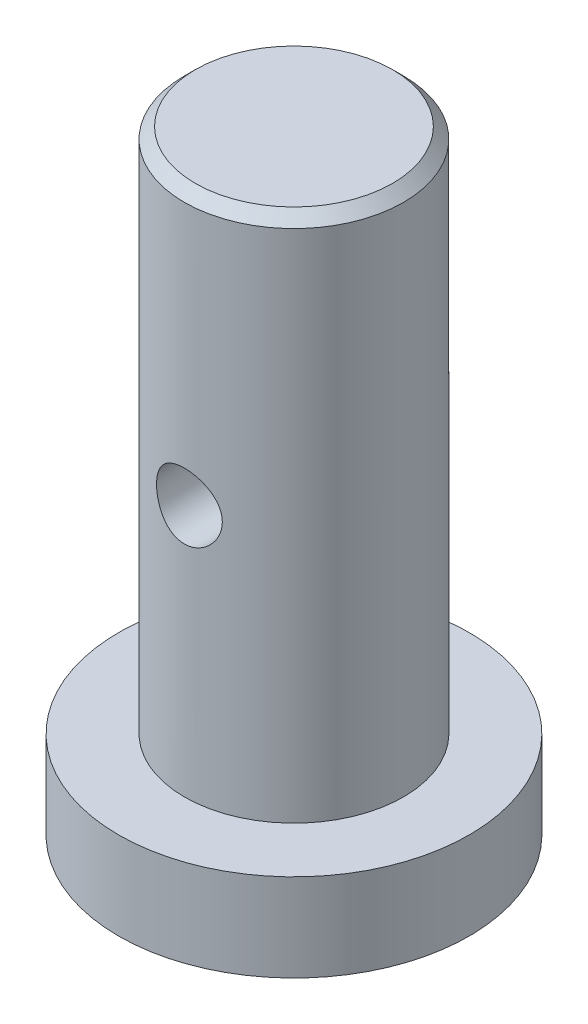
ISO-10303-21;
HEADER;
FILE_DESCRIPTION(('STEP AP214'),'2;1');
FILE_NAME('part.step','',(''),(''),'','','');
FILE_SCHEMA(('AUTOMOTIVE_DESIGN { 1 0 10303 214 1 1 1 1 }'));
ENDSEC;
DATA;
#1=APPLICATION_CONTEXT('core data for automotive mechanical design processes');
#2=APPLICATION_PROTOCOL_DEFINITION('international standard','automotive_design',2000,#1);
#3=PRODUCT_CONTEXT('',#1,'mechanical');
#4=PRODUCT('Part','Part','',(#3));
#5=PRODUCT_RELATED_PRODUCT_CATEGORY('part','',(#4));
#6=PRODUCT_DEFINITION_FORMATION('','',#4);
#7=PRODUCT_DEFINITION_CONTEXT('part definition',#1,'design');
#8=PRODUCT_DEFINITION('design','',#6,#7);
#9=PRODUCT_DEFINITION_SHAPE('','',#8);
#10=(LENGTH_UNIT() NAMED_UNIT(*) SI_UNIT(.MILLI.,.METRE.));
#11=(NAMED_UNIT(*) PLANE_ANGLE_UNIT() SI_UNIT($,.RADIAN.));
#12=(NAMED_UNIT(*) SI_UNIT($,.STERADIAN.) SOLID_ANGLE_UNIT());
#13=UNCERTAINTY_MEASURE_WITH_UNIT(LENGTH_MEASURE(1.E-05),#10,'distance_accuracy_value','');
#14=(GEOMETRIC_REPRESENTATION_CONTEXT(3) GLOBAL_UNCERTAINTY_ASSIGNED_CONTEXT((#13)) GLOBAL_UNIT_ASSIGNED_CONTEXT((#10,
#11,#12)) REPRESENTATION_CONTEXT('',''));
#15=CARTESIAN_POINT('',(0.,0.,0.));
#16=DIRECTION('',(0.,0.,1.));
#17=DIRECTION('',(1.,0.,0.));
#18=AXIS2_PLACEMENT_3D('',#15,#16,#17);
#19=CARTESIAN_POINT('',(-1.11022302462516E-13,27.9999999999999,0.));
#20=DIRECTION('',(0.,-1.,0.));
#21=DIRECTION('',(0.,0.,-1.00000000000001));
#22=AXIS2_PLACEMENT_3D('',#19,#20,#21);
#23=PLANE('',#22);
#24=CARTESIAN_POINT('',(-1.11022302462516E-13,27.9999999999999,0.));
#25=DIRECTION('',(0.,-1.,0.));
#26=DIRECTION('',(0.,0.,-1.00000000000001));
#27=AXIS2_PLACEMENT_3D('',#24,#25,#26);
#28=CIRCLE('',#27,4.5);
#29=CARTESIAN_POINT('',(-1.11022302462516E-13,27.9999999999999,-4.5000000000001));
#30=VERTEX_POINT('',#29);
#31=EDGE_CURVE('E42',#30,#30,#28,.F.);
#32=ORIENTED_EDGE('',*,*,#31,.T.);
#33=EDGE_LOOP('',(#32));
#34=FACE_BOUND('',#33,.T.);
#35=ADVANCED_FACE('F31',(#34),#23,.F.);
#36=CARTESIAN_POINT('',(0.,0.,0.));
#37=DIRECTION('',(0.,1.,0.));
#38=DIRECTION('',(0.,0.,1.00000000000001));
#39=AXIS2_PLACEMENT_3D('',#36,#37,#38);
#40=PLANE('',#39);
#41=CARTESIAN_POINT('',(0.,0.,0.));
#42=DIRECTION('',(0.,1.,0.));
#43=DIRECTION('',(0.,0.,1.00000000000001));
#44=AXIS2_PLACEMENT_3D('',#41,#42,#43);
#45=CIRCLE('',#44,8.);
#46=CARTESIAN_POINT('',(0.,0.,8.00000000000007));
#47=VERTEX_POINT('',#46);
#48=EDGE_CURVE('E47',#47,#47,#45,.T.);
#49=ORIENTED_EDGE('',*,*,#48,.F.);
#50=EDGE_LOOP('',(#49));
#51=FACE_BOUND('',#50,.T.);
#52=ADVANCED_FACE('F73',(#51),#40,.F.);
#53=CARTESIAN_POINT('',(1.11022302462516E-13,103.591101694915,3.88578058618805E-13));
#54=DIRECTION('',(0.,1.,0.));
#55=DIRECTION('',(0.,0.,1.00000000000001));
#56=AXIS2_PLACEMENT_3D('',#53,#54,#55);
#57=CYLINDRICAL_SURFACE('',#56,8.);
#58=CARTESIAN_POINT('',(-3.33066907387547E-13,4.,0.));
#59=DIRECTION('',(0.,1.,0.));
#60=DIRECTION('',(0.,0.,1.00000000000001));
#61=AXIS2_PLACEMENT_3D('',#58,#59,#60);
#62=CIRCLE('',#61,8.);
#63=CARTESIAN_POINT('',(-3.33066907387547E-13,4.,8.00000000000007));
#64=VERTEX_POINT('',#63);
#65=EDGE_CURVE('E97',#64,#64,#62,.T.);
#66=ORIENTED_EDGE('',*,*,#65,.F.);
#67=EDGE_LOOP('',(#66));
#68=FACE_BOUND('',#67,.T.);
#69=ORIENTED_EDGE('',*,*,#48,.T.);
#70=EDGE_LOOP('',(#69));
#71=FACE_BOUND('',#70,.T.);
#72=ADVANCED_FACE('F78',(#68,#71),#57,.T.);
#73=CARTESIAN_POINT('',(8.00000000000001,3.99999999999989,0.));
#74=DIRECTION('',(0.,-1.,0.));
#75=DIRECTION('',(0.,0.,-1.00000000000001));
#76=AXIS2_PLACEMENT_3D('',#73,#74,#75);
#77=PLANE('',#76);
#78=CARTESIAN_POINT('',(-3.33066907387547E-13,4.,0.));
#79=DIRECTION('',(0.,1.,0.));
#80=DIRECTION('',(0.,0.,1.00000000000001));
#81=AXIS2_PLACEMENT_3D('',#78,#79,#80);
#82=CIRCLE('',#81,5.);
#83=CARTESIAN_POINT('',(-3.33066907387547E-13,4.,5.00000000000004));
#84=VERTEX_POINT('',#83);
#85=EDGE_CURVE('E94',#84,#84,#82,.T.);
#86=ORIENTED_EDGE('',*,*,#85,.F.);
#87=EDGE_LOOP('',(#86));
#88=FACE_BOUND('',#87,.T.);
#89=ORIENTED_EDGE('',*,*,#65,.T.);
#90=EDGE_LOOP('',(#89));
#91=FACE_BOUND('',#90,.T.);
#92=ADVANCED_FACE('F69',(#88,#91),#77,.F.);
#93=CARTESIAN_POINT('',(1.11022302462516E-13,103.591101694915,3.88578058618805E-13));
#94=DIRECTION('',(0.,1.,0.));
#95=DIRECTION('',(0.,0.,1.00000000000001));
#96=AXIS2_PLACEMENT_3D('',#93,#94,#95);
#97=CYLINDRICAL_SURFACE('',#96,5.);
#98=CARTESIAN_POINT('',(6.10622663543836E-13,14.,5.00000000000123));
#99=CARTESIAN_POINT('',(-0.0822886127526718,14.0000009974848,4.9999992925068));
#100=CARTESIAN_POINT('',(-0.164587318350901,14.0067938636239,4.9979491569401));
#101=CARTESIAN_POINT('',(-0.326788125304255,14.033721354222,4.98997105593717));
#102=CARTESIAN_POINT('',(-0.406689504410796,14.0538599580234,4.98404193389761));
#103=CARTESIAN_POINT('',(-0.561732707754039,14.1067460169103,4.96895552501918));
#104=CARTESIAN_POINT('',(-0.636881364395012,14.1394748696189,4.95980300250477));
#105=CARTESIAN_POINT('',(-0.780624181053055,14.2165360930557,4.93922109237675));
#106=CARTESIAN_POINT('',(-0.849217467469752,14.2608700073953,4.92779140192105));
#107=CARTESIAN_POINT('',(-0.979871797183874,14.3612240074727,4.90350737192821));
#108=CARTESIAN_POINT('',(-1.04171807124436,14.417516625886,4.89062383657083));
#109=CARTESIAN_POINT('',(-1.15524920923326,14.5396092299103,4.86505834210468));
#110=CARTESIAN_POINT('',(-1.20693236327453,14.605410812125,4.85237641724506));
#111=CARTESIAN_POINT('',(-1.29980037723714,14.7464707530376,4.8283411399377));
#112=CARTESIAN_POINT('',(-1.34072309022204,14.8219084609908,4.81702406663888));
#113=CARTESIAN_POINT('',(-1.40921394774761,14.9789892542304,4.79743620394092));
#114=CARTESIAN_POINT('',(-1.43678529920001,15.060630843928,4.78916468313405));
#115=CARTESIAN_POINT('',(-1.47701633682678,15.2253902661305,4.7769087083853));
#116=CARTESIAN_POINT('',(-1.49007196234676,15.308402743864,4.77281069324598));
#117=CARTESIAN_POINT('',(-1.50213730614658,15.4755331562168,4.76902789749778));
#118=CARTESIAN_POINT('',(-1.50115042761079,15.5596508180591,4.76934204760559));
#119=CARTESIAN_POINT('',(-1.48546977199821,15.7233839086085,4.77424744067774));
#120=CARTESIAN_POINT('',(-1.47127205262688,15.8030522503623,4.77868388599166));
#121=CARTESIAN_POINT('',(-1.43037420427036,15.9588197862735,4.79108356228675));
#122=CARTESIAN_POINT('',(-1.40367284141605,16.0349186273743,4.79904714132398));
#123=CARTESIAN_POINT('',(-1.33816026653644,16.1826003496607,4.81772733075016));
#124=CARTESIAN_POINT('',(-1.2991881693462,16.2541070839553,4.82848016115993));
#125=CARTESIAN_POINT('',(-1.21035222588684,16.3897320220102,4.85150987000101));
#126=CARTESIAN_POINT('',(-1.16048574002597,16.4538484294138,4.86378711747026));
#127=CARTESIAN_POINT('',(-1.04881290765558,16.575686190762,4.8891101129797));
#128=CARTESIAN_POINT('',(-0.986594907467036,16.6330286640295,4.90216654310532));
#129=CARTESIAN_POINT('',(-0.85326325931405,16.7365539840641,4.92712244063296));
#130=CARTESIAN_POINT('',(-0.782149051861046,16.7827361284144,4.93902183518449));
#131=CARTESIAN_POINT('',(-0.632355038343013,16.8628599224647,4.96043160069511));
#132=CARTESIAN_POINT('',(-0.553627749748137,16.8967175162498,4.96992543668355));
#133=CARTESIAN_POINT('',(-0.391245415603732,16.9505995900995,4.98533521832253));
#134=CARTESIAN_POINT('',(-0.307591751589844,16.9706279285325,4.99125216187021));
#135=CARTESIAN_POINT('',(-0.14095224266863,16.9956521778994,4.99868364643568));
#136=CARTESIAN_POINT('',(-0.0580500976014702,17.0011615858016,5.00034850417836));
#137=CARTESIAN_POINT('',(0.10749960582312,16.9984308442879,4.99952923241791));
#138=CARTESIAN_POINT('',(0.190147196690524,16.9901925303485,4.99704565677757));
#139=CARTESIAN_POINT('',(0.350903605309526,16.9606153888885,4.9883069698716));
#140=CARTESIAN_POINT('',(0.429072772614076,16.9395766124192,4.98213829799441));
#141=CARTESIAN_POINT('',(0.580754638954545,16.8853567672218,4.96674347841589));
#142=CARTESIAN_POINT('',(0.654266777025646,16.8521742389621,4.95751696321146));
#143=CARTESIAN_POINT('',(0.796437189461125,16.7737468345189,4.93669654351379));
#144=CARTESIAN_POINT('',(0.864943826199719,16.7282406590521,4.92505280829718));
#145=CARTESIAN_POINT('',(0.99352330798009,16.6267752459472,4.90073468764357));
#146=CARTESIAN_POINT('',(1.05359403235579,16.5708133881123,4.88806004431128));
#147=CARTESIAN_POINT('',(1.16585744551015,16.4476126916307,4.86253171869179));
#148=CARTESIAN_POINT('',(1.21768481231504,16.3800381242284,4.84968825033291));
#149=CARTESIAN_POINT('',(1.30928995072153,16.2368720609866,4.82576515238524));
#150=CARTESIAN_POINT('',(1.3490680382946,16.1612807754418,4.81468547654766));
#151=CARTESIAN_POINT('',(1.41517347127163,16.0044675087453,4.79567189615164));
#152=CARTESIAN_POINT('',(1.44156346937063,15.9232738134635,4.78772337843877));
#153=CARTESIAN_POINT('',(1.48021730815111,15.7573120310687,4.77591594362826));
#154=CARTESIAN_POINT('',(1.49248598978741,15.6725451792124,4.77205562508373));
#155=CARTESIAN_POINT('',(1.5022198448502,15.5056384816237,4.76899972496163));
#156=CARTESIAN_POINT('',(1.50028055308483,15.4235363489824,4.76961647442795));
#157=CARTESIAN_POINT('',(1.48307505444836,15.2608858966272,4.77499401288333));
#158=CARTESIAN_POINT('',(1.46780938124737,15.1803375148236,4.77975463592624));
#159=CARTESIAN_POINT('',(1.4247688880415,15.0240546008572,4.79275763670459));
#160=CARTESIAN_POINT('',(1.39715175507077,14.9482727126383,4.80095604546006));
#161=CARTESIAN_POINT('',(1.33031507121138,14.8023575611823,4.81990278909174));
#162=CARTESIAN_POINT('',(1.29109329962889,14.7322253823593,4.83065161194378));
#163=CARTESIAN_POINT('',(1.20048763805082,14.5968368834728,4.85397676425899));
#164=CARTESIAN_POINT('',(1.14871276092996,14.5318512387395,4.86660540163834));
#165=CARTESIAN_POINT('',(1.03517434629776,14.411297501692,4.89201320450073));
#166=CARTESIAN_POINT('',(0.973408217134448,14.3557318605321,4.90479240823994));
#167=CARTESIAN_POINT('',(0.839465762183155,14.2539765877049,4.9295093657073));
#168=CARTESIAN_POINT('',(0.767037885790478,14.2081085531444,4.94141159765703));
#169=CARTESIAN_POINT('',(0.61514137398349,14.1292648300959,4.96260680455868));
#170=CARTESIAN_POINT('',(0.535676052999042,14.0962831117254,4.97190099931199));
#171=CARTESIAN_POINT('',(0.380757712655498,14.0471047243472,4.98602174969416));
#172=CARTESIAN_POINT('',(0.305786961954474,14.0294883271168,4.99122027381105));
#173=CARTESIAN_POINT('',(0.153880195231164,14.0059364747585,4.99820944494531));
#174=CARTESIAN_POINT('',(0.0769445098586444,13.9999990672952,5.00000066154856));
#175=CARTESIAN_POINT('',(6.10622663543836E-13,14.,5.00000000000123));
#176=B_SPLINE_CURVE_WITH_KNOTS('',3,(#98,#99,#100,#101,#102,#103,#104,#105,#106,#107,#108,#109,
#110,#111,#112,#113,#114,#115,#116,#117,#118,#119,#120,#121,#122,#123,#124,#125,#126,#127,#128,
#129,#130,#131,#132,#133,#134,#135,#136,#137,#138,#139,#140,#141,#142,#143,#144,#145,#146,#147,
#148,#149,#150,#151,#152,#153,#154,#155,#156,#157,#158,#159,#160,#161,#162,#163,#164,#165,#166,
#167,#168,#169,#170,#171,#172,#173,#174,#175),.UNSPECIFIED.,.T.,.F.,(4,2,2,2,2,2,2,2,2,2,2,2,2,
2,2,2,2,2,2,2,2,2,2,2,2,2,2,2,2,2,2,2,2,2,2,2,2,2,4),(0.,0.2465832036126,0.493239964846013,
0.739533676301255,0.985860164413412,1.23855602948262,1.49129437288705,1.74971481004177,
2.00807314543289,2.25919689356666,2.51025978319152,2.75226016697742,2.99428443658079,
3.23962426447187,3.48502360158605,3.7406710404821,3.99633456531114,4.25371046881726,
4.51101453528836,4.75908809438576,5.00712853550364,5.24956746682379,5.49203554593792,
5.74011305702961,5.98825282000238,6.24540400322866,6.50254844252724,6.75847814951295,
7.01432009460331,7.25950155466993,7.50467319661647,7.74680040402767,7.98897397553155,
8.23996925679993,8.49102974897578,8.74942996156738,9.00770911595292,9.2383169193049,
9.46888616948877),.UNSPECIFIED.);
#177=CARTESIAN_POINT('',(6.10622663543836E-13,14.,5.00000000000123));
#178=VERTEX_POINT('',#177);
#179=EDGE_CURVE('E34',#178,#178,#176,.T.);
#180=ORIENTED_EDGE('',*,*,#179,.T.);
#181=EDGE_LOOP('',(#180));
#182=FACE_BOUND('',#181,.T.);
#183=CARTESIAN_POINT('',(1.49999999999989,15.5,-4.76969600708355));
#184=CARTESIAN_POINT('',(1.49999897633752,15.5821945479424,-4.76969685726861));
#185=CARTESIAN_POINT('',(1.49322108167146,15.664399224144,-4.77184390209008));
#186=CARTESIAN_POINT('',(1.46635844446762,15.8264052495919,-4.78016578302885));
#187=CARTESIAN_POINT('',(1.44626925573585,15.9062057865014,-4.78634196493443));
#188=CARTESIAN_POINT('',(1.39352753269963,16.0610347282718,-4.80196102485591));
#189=CARTESIAN_POINT('',(1.36089589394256,16.1360708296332,-4.81139846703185));
#190=CARTESIAN_POINT('',(1.28406421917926,16.2796219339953,-4.8324693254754));
#191=CARTESIAN_POINT('',(1.23986245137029,16.3481359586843,-4.84410307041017));
#192=CARTESIAN_POINT('',(1.139647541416,16.4788663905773,-4.86866862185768));
#193=CARTESIAN_POINT('',(1.08333207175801,16.5408458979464,-4.88162808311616));
#194=CARTESIAN_POINT('',(0.961136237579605,16.6546379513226,-4.90714861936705));
#195=CARTESIAN_POINT('',(0.895254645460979,16.7064491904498,-4.91970964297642));
#196=CARTESIAN_POINT('',(0.754111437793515,16.7994626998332,-4.94333214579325));
#197=CARTESIAN_POINT('',(0.678684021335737,16.8404234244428,-4.95435724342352));
#198=CARTESIAN_POINT('',(0.521624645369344,16.9089872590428,-4.97334435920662));
#199=CARTESIAN_POINT('',(0.439994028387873,16.9365932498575,-4.98130703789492));
#200=CARTESIAN_POINT('',(0.275323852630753,16.9768800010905,-4.99307646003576));
#201=CARTESIAN_POINT('',(0.192391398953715,16.9899651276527,-4.99699557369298));
#202=CARTESIAN_POINT('',(0.0254218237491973,17.0021173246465,-5.00063201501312));
#203=CARTESIAN_POINT('',(-0.0586150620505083,17.001187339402,-5.00035022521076));
#204=CARTESIAN_POINT('',(-0.222571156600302,16.9856071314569,-4.99569603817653));
#205=CARTESIAN_POINT('',(-0.302536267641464,16.9713948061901,-4.99145420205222));
#206=CARTESIAN_POINT('',(-0.458889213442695,16.9303686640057,-4.9795152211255));
#207=CARTESIAN_POINT('',(-0.53527682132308,16.9035540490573,-4.9718178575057));
#208=CARTESIAN_POINT('',(-0.683347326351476,16.8377879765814,-4.95365220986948));
#209=CARTESIAN_POINT('',(-0.754965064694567,16.7986987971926,-4.94315269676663));
#210=CARTESIAN_POINT('',(-0.890764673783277,16.7096021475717,-4.92049640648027));
#211=CARTESIAN_POINT('',(-0.954944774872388,16.6595920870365,-4.90833923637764));
#212=CARTESIAN_POINT('',(-1.07666048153,16.5478022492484,-4.88311550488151));
#213=CARTESIAN_POINT('',(-1.13384458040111,16.4856430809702,-4.87003195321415));
#214=CARTESIAN_POINT('',(-1.23707651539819,16.3524899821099,-4.84483979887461));
#215=CARTESIAN_POINT('',(-1.28312324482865,16.2814951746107,-4.83273129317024));
#216=CARTESIAN_POINT('',(-1.36313995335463,16.131760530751,-4.81077903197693));
#217=CARTESIAN_POINT('',(-1.39698989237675,16.0529529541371,-4.80095810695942));
#218=CARTESIAN_POINT('',(-1.45083362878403,15.8903927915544,-4.78496392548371));
#219=CARTESIAN_POINT('',(-1.47083194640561,15.8066418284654,-4.77878947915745));
#220=CARTESIAN_POINT('',(-1.49574770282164,15.6399176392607,-4.77104849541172));
#221=CARTESIAN_POINT('',(-1.50119946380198,15.5570317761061,-4.76931878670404));
#222=CARTESIAN_POINT('',(-1.4983594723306,15.3915270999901,-4.77021192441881));
#223=CARTESIAN_POINT('',(-1.49006964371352,15.3089082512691,-4.77283416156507));
#224=CARTESIAN_POINT('',(-1.46045763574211,15.1485116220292,-4.78197558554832));
#225=CARTESIAN_POINT('',(-1.43947961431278,15.0706638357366,-4.78839176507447));
#226=CARTESIAN_POINT('',(-1.38548577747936,14.9195983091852,-4.80429141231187));
#227=CARTESIAN_POINT('',(-1.35246810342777,14.8463812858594,-4.81377535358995));
#228=CARTESIAN_POINT('',(-1.27431871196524,14.7044825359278,-4.83505835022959));
#229=CARTESIAN_POINT('',(-1.22888564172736,14.6359752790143,-4.8469127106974));
#230=CARTESIAN_POINT('',(-1.12755301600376,14.5073618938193,-4.87148205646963));
#231=CARTESIAN_POINT('',(-1.0716509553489,14.4472577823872,-4.88419724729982));
#232=CARTESIAN_POINT('',(-0.948455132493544,14.3348195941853,-4.9096363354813));
#233=CARTESIAN_POINT('',(-0.880811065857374,14.2828643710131,-4.92234245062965));
#234=CARTESIAN_POINT('',(-0.737461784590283,14.1910332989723,-4.94584851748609));
#235=CARTESIAN_POINT('',(-0.661756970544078,14.1511568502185,-4.95664856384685));
#236=CARTESIAN_POINT('',(-0.504935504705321,14.0849999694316,-4.97505970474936));
#237=CARTESIAN_POINT('',(-0.423864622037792,14.058617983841,-4.98269453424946));
#238=CARTESIAN_POINT('',(-0.258169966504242,14.0199390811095,-4.9940197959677));
#239=CARTESIAN_POINT('',(-0.173547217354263,14.0076381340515,-4.99771135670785));
#240=CARTESIAN_POINT('',(-0.00665215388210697,13.9977769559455,-5.00066544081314));
#241=CARTESIAN_POINT('',(0.0755851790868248,13.9996673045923,-5.00009305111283));
#242=CARTESIAN_POINT('',(0.238519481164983,14.0168216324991,-4.99497264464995));
#243=CARTESIAN_POINT('',(0.319216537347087,14.0320848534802,-4.99042485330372));
#244=CARTESIAN_POINT('',(0.475935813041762,14.0752116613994,-4.97791168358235));
#245=CARTESIAN_POINT('',(0.551998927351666,14.102938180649,-4.96998352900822));
#246=CARTESIAN_POINT('',(0.698433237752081,14.1700819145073,-4.95152943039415));
#247=CARTESIAN_POINT('',(0.76880349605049,14.2095010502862,-4.94100305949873));
#248=CARTESIAN_POINT('',(0.904301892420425,14.3003734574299,-4.91803965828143));
#249=CARTESIAN_POINT('',(0.969190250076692,14.3521714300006,-4.90555226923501));
#250=CARTESIAN_POINT('',(1.08953757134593,14.4657103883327,-4.88023537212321));
#251=CARTESIAN_POINT('',(1.14499380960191,14.5274542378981,-4.86740576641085));
#252=CARTESIAN_POINT('',(1.24656269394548,14.6613407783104,-4.84240680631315));
#253=CARTESIAN_POINT('',(1.29234759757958,14.7337385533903,-4.83026852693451));
#254=CARTESIAN_POINT('',(1.37104313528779,14.8855551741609,-4.80852547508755));
#255=CARTESIAN_POINT('',(1.40395995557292,14.9649706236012,-4.79891948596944));
#256=CARTESIAN_POINT('',(1.45301942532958,15.1197404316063,-4.78427816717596));
#257=CARTESIAN_POINT('',(1.47058859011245,15.194608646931,-4.77886154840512));
#258=CARTESIAN_POINT('',(1.49407818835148,15.3463152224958,-4.77157042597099));
#259=CARTESIAN_POINT('',(1.50000095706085,15.4231531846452,-4.76969521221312));
#260=CARTESIAN_POINT('',(1.49999999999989,15.5,-4.76969600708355));
#261=B_SPLINE_CURVE_WITH_KNOTS('',3,(#183,#184,#185,#186,#187,#188,#189,#190,#191,#192,#193,
#194,#195,#196,#197,#198,#199,#200,#201,#202,#203,#204,#205,#206,#207,#208,#209,#210,#211,#212,
#213,#214,#215,#216,#217,#218,#219,#220,#221,#222,#223,#224,#225,#226,#227,#228,#229,#230,#231,
#232,#233,#234,#235,#236,#237,#238,#239,#240,#241,#242,#243,#244,#245,#246,#247,#248,#249,#250,
#251,#252,#253,#254,#255,#256,#257,#258,#259,#260),.UNSPECIFIED.,.T.,.F.,(4,2,2,2,2,2,2,2,2,2,2,
2,2,2,2,2,2,2,2,2,2,2,2,2,2,2,2,2,2,2,2,2,2,2,2,2,2,2,4),(0.,0.246300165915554,
0.492682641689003,0.738656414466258,0.984667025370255,1.23773150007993,1.49082847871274,
1.74915939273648,2.00743455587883,2.25832140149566,2.50915554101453,2.75200125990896,
2.99486235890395,3.24055209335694,3.48630016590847,3.74152147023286,3.99676812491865,
4.25446238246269,4.51207250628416,4.76008080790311,5.00805439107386,5.24958594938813,
5.49115481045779,5.73920731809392,5.98731925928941,6.2447950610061,6.50225807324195,
6.75775391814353,7.01317662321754,7.25876303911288,7.50433553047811,7.74727096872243,
7.99024634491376,8.24099627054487,8.49181852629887,8.75011639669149,9.00828993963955,
9.23861153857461,9.46888695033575),.UNSPECIFIED.);
#262=CARTESIAN_POINT('',(1.49999999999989,15.5,-4.76969600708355));
#263=VERTEX_POINT('',#262);
#264=EDGE_CURVE('E50',#263,#263,#261,.T.);
#265=ORIENTED_EDGE('',*,*,#264,.T.);
#266=EDGE_LOOP('',(#265));
#267=FACE_BOUND('',#266,.T.);
#268=CARTESIAN_POINT('',(-1.11022302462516E-13,27.4999999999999,0.));
#269=DIRECTION('',(0.,-1.,0.));
#270=DIRECTION('',(0.,0.,-1.00000000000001));
#271=AXIS2_PLACEMENT_3D('',#268,#269,#270);
#272=CIRCLE('',#271,5.);
#273=CARTESIAN_POINT('',(-1.11022302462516E-13,27.4999999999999,-5.0000000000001));
#274=VERTEX_POINT('',#273);
#275=EDGE_CURVE('E10',#274,#274,#272,.T.);
#276=ORIENTED_EDGE('',*,*,#275,.T.);
#277=EDGE_LOOP('',(#276));
#278=FACE_BOUND('',#277,.T.);
#279=ORIENTED_EDGE('',*,*,#85,.T.);
#280=EDGE_LOOP('',(#279));
#281=FACE_BOUND('',#280,.T.);
#282=ADVANCED_FACE('F54',(#182,#267,#278,#281),#97,.T.);
#283=CARTESIAN_POINT('',(-1.11022302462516E-13,27.9999999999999,0.));
#284=DIRECTION('',(0.,-1.,0.));
#285=DIRECTION('',(0.,0.,-1.00000000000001));
#286=AXIS2_PLACEMENT_3D('',#283,#284,#285);
#287=CONICAL_SURFACE('',#286,4.5,0.785398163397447);
#288=ORIENTED_EDGE('',*,*,#275,.F.);
#289=EDGE_LOOP('',(#288));
#290=FACE_BOUND('',#289,.T.);
#291=ORIENTED_EDGE('',*,*,#31,.F.);
#292=EDGE_LOOP('',(#291));
#293=FACE_BOUND('',#292,.T.);
#294=ADVANCED_FACE('F61',(#290,#293),#287,.T.);
#295=CARTESIAN_POINT('',(0.,15.5,-7.99999999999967));
#296=DIRECTION('',(0.,0.,1.00000000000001));
#297=DIRECTION('',(1.00000000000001,0.,0.));
#298=AXIS2_PLACEMENT_3D('',#295,#296,#297);
#299=CYLINDRICAL_SURFACE('',#298,1.5);
#300=ORIENTED_EDGE('',*,*,#264,.F.);
#301=EDGE_LOOP('',(#300));
#302=FACE_BOUND('',#301,.T.);
#303=ORIENTED_EDGE('',*,*,#179,.F.);
#304=EDGE_LOOP('',(#303));
#305=FACE_BOUND('',#304,.T.);
#306=ADVANCED_FACE('F58',(#302,#305),#299,.F.);
#307=CLOSED_SHELL('',(#35,#52,#72,#92,#282,#294,#306));
#308=MANIFOLD_SOLID_BREP('B2',#307);
#309=ADVANCED_BREP_SHAPE_REPRESENTATION('',(#18,#308),#14);
#310=SHAPE_DEFINITION_REPRESENTATION(#9,#309);
ENDSEC;
END-ISO-10303-21;
